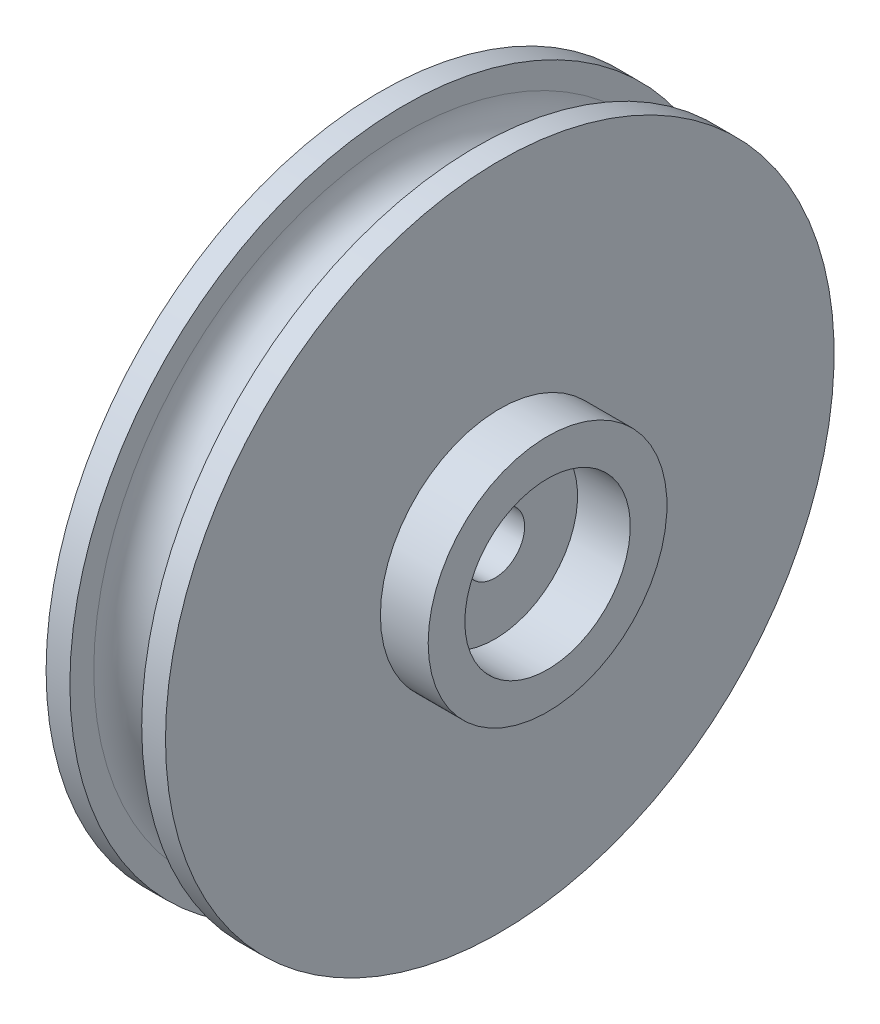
ISO-10303-21;
HEADER;
FILE_DESCRIPTION(('STEP AP214'),'2;1');
FILE_NAME('part.step','',(''),(''),'','','');
FILE_SCHEMA(('AUTOMOTIVE_DESIGN { 1 0 10303 214 1 1 1 1 }'));
ENDSEC;
DATA;
#1=APPLICATION_CONTEXT('core data for automotive mechanical design processes');
#2=APPLICATION_PROTOCOL_DEFINITION('international standard','automotive_design',2000,#1);
#3=PRODUCT_CONTEXT('',#1,'mechanical');
#4=PRODUCT('Part','Part','',(#3));
#5=PRODUCT_RELATED_PRODUCT_CATEGORY('part','',(#4));
#6=PRODUCT_DEFINITION_FORMATION('','',#4);
#7=PRODUCT_DEFINITION_CONTEXT('part definition',#1,'design');
#8=PRODUCT_DEFINITION('design','',#6,#7);
#9=PRODUCT_DEFINITION_SHAPE('','',#8);
#10=(LENGTH_UNIT() NAMED_UNIT(*) SI_UNIT(.MILLI.,.METRE.));
#11=(NAMED_UNIT(*) PLANE_ANGLE_UNIT() SI_UNIT($,.RADIAN.));
#12=(NAMED_UNIT(*) SI_UNIT($,.STERADIAN.) SOLID_ANGLE_UNIT());
#13=UNCERTAINTY_MEASURE_WITH_UNIT(LENGTH_MEASURE(1.E-05),#10,'distance_accuracy_value','');
#14=(GEOMETRIC_REPRESENTATION_CONTEXT(3) GLOBAL_UNCERTAINTY_ASSIGNED_CONTEXT((#13)) GLOBAL_UNIT_ASSIGNED_CONTEXT((#10,
#11,#12)) REPRESENTATION_CONTEXT('',''));
#15=CARTESIAN_POINT('',(0.,0.,0.));
#16=DIRECTION('',(0.,0.,1.));
#17=DIRECTION('',(1.,0.,0.));
#18=AXIS2_PLACEMENT_3D('',#15,#16,#17);
#19=CARTESIAN_POINT('',(0.,0.,0.));
#20=DIRECTION('',(-1.,0.,0.));
#21=DIRECTION('',(0.,0.,1.));
#22=AXIS2_PLACEMENT_3D('',#19,#20,#21);
#23=CYLINDRICAL_SURFACE('',#22,11.);
#24=CARTESIAN_POINT('',(-7.2771,0.,0.));
#25=DIRECTION('',(-1.,0.,0.));
#26=DIRECTION('',(0.,0.,1.));
#27=AXIS2_PLACEMENT_3D('',#24,#25,#26);
#28=CIRCLE('',#27,11.);
#29=CARTESIAN_POINT('',(-7.2771,0.,11.));
#30=VERTEX_POINT('',#29);
#31=EDGE_CURVE('E83',#30,#30,#28,.T.);
#32=ORIENTED_EDGE('',*,*,#31,.F.);
#33=EDGE_LOOP('',(#32));
#34=FACE_BOUND('',#33,.T.);
#35=CARTESIAN_POINT('',(-14.2875,0.,0.));
#36=DIRECTION('',(-1.,0.,0.));
#37=DIRECTION('',(0.,0.,1.));
#38=AXIS2_PLACEMENT_3D('',#35,#36,#37);
#39=CIRCLE('',#38,11.);
#40=CARTESIAN_POINT('',(-14.2875,0.,11.));
#41=VERTEX_POINT('',#40);
#42=EDGE_CURVE('E10',#41,#41,#39,.T.);
#43=ORIENTED_EDGE('',*,*,#42,.T.);
#44=EDGE_LOOP('',(#43));
#45=FACE_BOUND('',#44,.T.);
#46=ADVANCED_FACE('F31',(#34,#45),#23,.F.);
#47=CARTESIAN_POINT('',(-14.2875,15.875,0.));
#48=DIRECTION('',(1.,0.,0.));
#49=DIRECTION('',(0.,0.,-1.));
#50=AXIS2_PLACEMENT_3D('',#47,#48,#49);
#51=PLANE('',#50);
#52=ORIENTED_EDGE('',*,*,#42,.F.);
#53=EDGE_LOOP('',(#52));
#54=FACE_BOUND('',#53,.T.);
#55=CARTESIAN_POINT('',(-14.2875,0.,0.));
#56=DIRECTION('',(-1.,0.,0.));
#57=DIRECTION('',(0.,0.,1.));
#58=AXIS2_PLACEMENT_3D('',#55,#56,#57);
#59=CIRCLE('',#58,15.875);
#60=CARTESIAN_POINT('',(-14.2875,0.,15.875));
#61=VERTEX_POINT('',#60);
#62=EDGE_CURVE('E37',#61,#61,#59,.T.);
#63=ORIENTED_EDGE('',*,*,#62,.T.);
#64=EDGE_LOOP('',(#63));
#65=FACE_BOUND('',#64,.T.);
#66=ADVANCED_FACE('F90',(#54,#65),#51,.F.);
#67=CARTESIAN_POINT('',(0.,0.,0.));
#68=DIRECTION('',(-1.,0.,0.));
#69=DIRECTION('',(0.,0.,1.));
#70=AXIS2_PLACEMENT_3D('',#67,#68,#69);
#71=CYLINDRICAL_SURFACE('',#70,15.875);
#72=ORIENTED_EDGE('',*,*,#62,.F.);
#73=EDGE_LOOP('',(#72));
#74=FACE_BOUND('',#73,.T.);
#75=CARTESIAN_POINT('',(-7.9375,0.,0.));
#76=DIRECTION('',(-1.,0.,0.));
#77=DIRECTION('',(0.,0.,1.));
#78=AXIS2_PLACEMENT_3D('',#75,#76,#77);
#79=CIRCLE('',#78,15.875);
#80=CARTESIAN_POINT('',(-7.9375,0.,15.875));
#81=VERTEX_POINT('',#80);
#82=EDGE_CURVE('E41',#81,#81,#79,.T.);
#83=ORIENTED_EDGE('',*,*,#82,.T.);
#84=EDGE_LOOP('',(#83));
#85=FACE_BOUND('',#84,.T.);
#86=ADVANCED_FACE('F94',(#74,#85),#71,.T.);
#87=CARTESIAN_POINT('',(-7.9375,44.45,0.));
#88=DIRECTION('',(1.,0.,0.));
#89=DIRECTION('',(0.,0.,-1.));
#90=AXIS2_PLACEMENT_3D('',#87,#88,#89);
#91=PLANE('',#90);
#92=ORIENTED_EDGE('',*,*,#82,.F.);
#93=EDGE_LOOP('',(#92));
#94=FACE_BOUND('',#93,.T.);
#95=CARTESIAN_POINT('',(-7.9375,0.,0.));
#96=DIRECTION('',(-1.,0.,0.));
#97=DIRECTION('',(0.,0.,1.));
#98=AXIS2_PLACEMENT_3D('',#95,#96,#97);
#99=CIRCLE('',#98,44.45);
#100=CARTESIAN_POINT('',(-7.9375,0.,44.45));
#101=VERTEX_POINT('',#100);
#102=EDGE_CURVE('E45',#101,#101,#99,.T.);
#103=ORIENTED_EDGE('',*,*,#102,.T.);
#104=EDGE_LOOP('',(#103));
#105=FACE_BOUND('',#104,.T.);
#106=ADVANCED_FACE('F99',(#94,#105),#91,.F.);
#107=CARTESIAN_POINT('',(0.,0.,0.));
#108=DIRECTION('',(-1.,0.,0.));
#109=DIRECTION('',(0.,0.,1.));
#110=AXIS2_PLACEMENT_3D('',#107,#108,#109);
#111=CYLINDRICAL_SURFACE('',#110,44.45);
#112=ORIENTED_EDGE('',*,*,#102,.F.);
#113=EDGE_LOOP('',(#112));
#114=FACE_BOUND('',#113,.T.);
#115=CARTESIAN_POINT('',(-4.7752,0.,0.));
#116=DIRECTION('',(-1.,0.,0.));
#117=DIRECTION('',(0.,0.,1.));
#118=AXIS2_PLACEMENT_3D('',#115,#116,#117);
#119=CIRCLE('',#118,44.45);
#120=CARTESIAN_POINT('',(-4.7752,0.,44.45));
#121=VERTEX_POINT('',#120);
#122=EDGE_CURVE('E50',#121,#121,#119,.T.);
#123=ORIENTED_EDGE('',*,*,#122,.T.);
#124=EDGE_LOOP('',(#123));
#125=FACE_BOUND('',#124,.T.);
#126=ADVANCED_FACE('F105',(#114,#125),#111,.T.);
#127=CARTESIAN_POINT('',(-4.7752,41.275,0.));
#128=DIRECTION('',(-1.,0.,0.));
#129=DIRECTION('',(0.,0.,1.));
#130=AXIS2_PLACEMENT_3D('',#127,#128,#129);
#131=PLANE('',#130);
#132=ORIENTED_EDGE('',*,*,#122,.F.);
#133=EDGE_LOOP('',(#132));
#134=FACE_BOUND('',#133,.T.);
#135=CARTESIAN_POINT('',(-4.7752,0.,0.));
#136=DIRECTION('',(-1.,0.,0.));
#137=DIRECTION('',(0.,0.,1.));
#138=AXIS2_PLACEMENT_3D('',#135,#136,#137);
#139=CIRCLE('',#138,41.275);
#140=CARTESIAN_POINT('',(-4.7752,0.,41.275));
#141=VERTEX_POINT('',#140);
#142=EDGE_CURVE('E53',#141,#141,#139,.T.);
#143=ORIENTED_EDGE('',*,*,#142,.T.);
#144=EDGE_LOOP('',(#143));
#145=FACE_BOUND('',#144,.T.);
#146=ADVANCED_FACE('F109',(#134,#145),#131,.F.);
#147=CARTESIAN_POINT('',(0.,0.,0.));
#148=DIRECTION('',(-1.,0.,0.));
#149=DIRECTION('',(0.,0.,1.));
#150=AXIS2_PLACEMENT_3D('',#147,#148,#149);
#151=TOROIDAL_SURFACE('',#150,41.275,4.7752);
#152=ORIENTED_EDGE('',*,*,#142,.F.);
#153=EDGE_LOOP('',(#152));
#154=FACE_BOUND('',#153,.T.);
#155=CARTESIAN_POINT('',(4.7752,0.,0.));
#156=DIRECTION('',(-1.,0.,0.));
#157=DIRECTION('',(0.,0.,1.));
#158=AXIS2_PLACEMENT_3D('',#155,#156,#157);
#159=CIRCLE('',#158,41.275);
#160=CARTESIAN_POINT('',(4.7752,0.,41.275));
#161=VERTEX_POINT('',#160);
#162=EDGE_CURVE('E56',#161,#161,#159,.T.);
#163=ORIENTED_EDGE('',*,*,#162,.T.);
#164=EDGE_LOOP('',(#163));
#165=FACE_BOUND('',#164,.T.);
#166=ADVANCED_FACE('F113',(#154,#165),#151,.F.);
#167=CARTESIAN_POINT('',(4.7752,44.45,0.));
#168=DIRECTION('',(1.,0.,0.));
#169=DIRECTION('',(0.,0.,-1.));
#170=AXIS2_PLACEMENT_3D('',#167,#168,#169);
#171=PLANE('',#170);
#172=ORIENTED_EDGE('',*,*,#162,.F.);
#173=EDGE_LOOP('',(#172));
#174=FACE_BOUND('',#173,.T.);
#175=CARTESIAN_POINT('',(4.7752,0.,0.));
#176=DIRECTION('',(-1.,0.,0.));
#177=DIRECTION('',(0.,0.,1.));
#178=AXIS2_PLACEMENT_3D('',#175,#176,#177);
#179=CIRCLE('',#178,44.45);
#180=CARTESIAN_POINT('',(4.7752,0.,44.45));
#181=VERTEX_POINT('',#180);
#182=EDGE_CURVE('E59',#181,#181,#179,.T.);
#183=ORIENTED_EDGE('',*,*,#182,.T.);
#184=EDGE_LOOP('',(#183));
#185=FACE_BOUND('',#184,.T.);
#186=ADVANCED_FACE('F117',(#174,#185),#171,.F.);
#187=CARTESIAN_POINT('',(0.,0.,0.));
#188=DIRECTION('',(-1.,0.,0.));
#189=DIRECTION('',(0.,0.,1.));
#190=AXIS2_PLACEMENT_3D('',#187,#188,#189);
#191=CYLINDRICAL_SURFACE('',#190,44.45);
#192=ORIENTED_EDGE('',*,*,#182,.F.);
#193=EDGE_LOOP('',(#192));
#194=FACE_BOUND('',#193,.T.);
#195=CARTESIAN_POINT('',(7.9375,0.,0.));
#196=DIRECTION('',(-1.,0.,0.));
#197=DIRECTION('',(0.,0.,1.));
#198=AXIS2_PLACEMENT_3D('',#195,#196,#197);
#199=CIRCLE('',#198,44.45);
#200=CARTESIAN_POINT('',(7.9375,0.,44.45));
#201=VERTEX_POINT('',#200);
#202=EDGE_CURVE('E62',#201,#201,#199,.T.);
#203=ORIENTED_EDGE('',*,*,#202,.T.);
#204=EDGE_LOOP('',(#203));
#205=FACE_BOUND('',#204,.T.);
#206=ADVANCED_FACE('F121',(#194,#205),#191,.T.);
#207=CARTESIAN_POINT('',(7.9375,15.875,0.));
#208=DIRECTION('',(-1.,0.,0.));
#209=DIRECTION('',(0.,0.,1.));
#210=AXIS2_PLACEMENT_3D('',#207,#208,#209);
#211=PLANE('',#210);
#212=ORIENTED_EDGE('',*,*,#202,.F.);
#213=EDGE_LOOP('',(#212));
#214=FACE_BOUND('',#213,.T.);
#215=CARTESIAN_POINT('',(7.9375,0.,0.));
#216=DIRECTION('',(-1.,0.,0.));
#217=DIRECTION('',(0.,0.,1.));
#218=AXIS2_PLACEMENT_3D('',#215,#216,#217);
#219=CIRCLE('',#218,15.875);
#220=CARTESIAN_POINT('',(7.9375,0.,15.875));
#221=VERTEX_POINT('',#220);
#222=EDGE_CURVE('E65',#221,#221,#219,.T.);
#223=ORIENTED_EDGE('',*,*,#222,.T.);
#224=EDGE_LOOP('',(#223));
#225=FACE_BOUND('',#224,.T.);
#226=ADVANCED_FACE('F125',(#214,#225),#211,.F.);
#227=CARTESIAN_POINT('',(0.,0.,0.));
#228=DIRECTION('',(-1.,0.,0.));
#229=DIRECTION('',(0.,0.,1.));
#230=AXIS2_PLACEMENT_3D('',#227,#228,#229);
#231=CYLINDRICAL_SURFACE('',#230,15.875);
#232=ORIENTED_EDGE('',*,*,#222,.F.);
#233=EDGE_LOOP('',(#232));
#234=FACE_BOUND('',#233,.T.);
#235=CARTESIAN_POINT('',(14.2875,0.,0.));
#236=DIRECTION('',(-1.,0.,0.));
#237=DIRECTION('',(0.,0.,1.));
#238=AXIS2_PLACEMENT_3D('',#235,#236,#237);
#239=CIRCLE('',#238,15.875);
#240=CARTESIAN_POINT('',(14.2875,0.,15.875));
#241=VERTEX_POINT('',#240);
#242=EDGE_CURVE('E68',#241,#241,#239,.T.);
#243=ORIENTED_EDGE('',*,*,#242,.T.);
#244=EDGE_LOOP('',(#243));
#245=FACE_BOUND('',#244,.T.);
#246=ADVANCED_FACE('F129',(#234,#245),#231,.T.);
#247=CARTESIAN_POINT('',(14.2875,15.875,0.));
#248=DIRECTION('',(-1.,0.,0.));
#249=DIRECTION('',(0.,0.,1.));
#250=AXIS2_PLACEMENT_3D('',#247,#248,#249);
#251=PLANE('',#250);
#252=ORIENTED_EDGE('',*,*,#242,.F.);
#253=EDGE_LOOP('',(#252));
#254=FACE_BOUND('',#253,.T.);
#255=CARTESIAN_POINT('',(14.2875,0.,0.));
#256=DIRECTION('',(-1.,0.,0.));
#257=DIRECTION('',(0.,0.,1.));
#258=AXIS2_PLACEMENT_3D('',#255,#256,#257);
#259=CIRCLE('',#258,11.);
#260=CARTESIAN_POINT('',(14.2875,0.,11.));
#261=VERTEX_POINT('',#260);
#262=EDGE_CURVE('E71',#261,#261,#259,.T.);
#263=ORIENTED_EDGE('',*,*,#262,.T.);
#264=EDGE_LOOP('',(#263));
#265=FACE_BOUND('',#264,.T.);
#266=ADVANCED_FACE('F133',(#254,#265),#251,.F.);
#267=CARTESIAN_POINT('',(0.,0.,0.));
#268=DIRECTION('',(-1.,0.,0.));
#269=DIRECTION('',(0.,0.,1.));
#270=AXIS2_PLACEMENT_3D('',#267,#268,#269);
#271=CYLINDRICAL_SURFACE('',#270,11.);
#272=ORIENTED_EDGE('',*,*,#262,.F.);
#273=EDGE_LOOP('',(#272));
#274=FACE_BOUND('',#273,.T.);
#275=CARTESIAN_POINT('',(7.2771,0.,0.));
#276=DIRECTION('',(-1.,0.,0.));
#277=DIRECTION('',(0.,0.,1.));
#278=AXIS2_PLACEMENT_3D('',#275,#276,#277);
#279=CIRCLE('',#278,11.);
#280=CARTESIAN_POINT('',(7.2771,0.,11.));
#281=VERTEX_POINT('',#280);
#282=EDGE_CURVE('E74',#281,#281,#279,.T.);
#283=ORIENTED_EDGE('',*,*,#282,.T.);
#284=EDGE_LOOP('',(#283));
#285=FACE_BOUND('',#284,.T.);
#286=ADVANCED_FACE('F137',(#274,#285),#271,.F.);
#287=CARTESIAN_POINT('',(7.2771,3.9624,0.));
#288=DIRECTION('',(-1.,0.,0.));
#289=DIRECTION('',(0.,0.,1.));
#290=AXIS2_PLACEMENT_3D('',#287,#288,#289);
#291=PLANE('',#290);
#292=ORIENTED_EDGE('',*,*,#282,.F.);
#293=EDGE_LOOP('',(#292));
#294=FACE_BOUND('',#293,.T.);
#295=CARTESIAN_POINT('',(7.2771,0.,0.));
#296=DIRECTION('',(-1.,0.,0.));
#297=DIRECTION('',(0.,0.,1.));
#298=AXIS2_PLACEMENT_3D('',#295,#296,#297);
#299=CIRCLE('',#298,3.9624);
#300=CARTESIAN_POINT('',(7.2771,0.,3.9624));
#301=VERTEX_POINT('',#300);
#302=EDGE_CURVE('E77',#301,#301,#299,.T.);
#303=ORIENTED_EDGE('',*,*,#302,.T.);
#304=EDGE_LOOP('',(#303));
#305=FACE_BOUND('',#304,.T.);
#306=ADVANCED_FACE('F141',(#294,#305),#291,.F.);
#307=CARTESIAN_POINT('',(0.,0.,0.));
#308=DIRECTION('',(-1.,0.,0.));
#309=DIRECTION('',(0.,0.,1.));
#310=AXIS2_PLACEMENT_3D('',#307,#308,#309);
#311=CYLINDRICAL_SURFACE('',#310,3.9624);
#312=ORIENTED_EDGE('',*,*,#302,.F.);
#313=EDGE_LOOP('',(#312));
#314=FACE_BOUND('',#313,.T.);
#315=CARTESIAN_POINT('',(-7.2771,0.,0.));
#316=DIRECTION('',(-1.,0.,0.));
#317=DIRECTION('',(0.,0.,1.));
#318=AXIS2_PLACEMENT_3D('',#315,#316,#317);
#319=CIRCLE('',#318,3.9624);
#320=CARTESIAN_POINT('',(-7.2771,0.,3.9624));
#321=VERTEX_POINT('',#320);
#322=EDGE_CURVE('E80',#321,#321,#319,.T.);
#323=ORIENTED_EDGE('',*,*,#322,.T.);
#324=EDGE_LOOP('',(#323));
#325=FACE_BOUND('',#324,.T.);
#326=ADVANCED_FACE('F145',(#314,#325),#311,.F.);
#327=CARTESIAN_POINT('',(-7.2771,11.,0.));
#328=DIRECTION('',(1.,0.,0.));
#329=DIRECTION('',(0.,0.,-1.));
#330=AXIS2_PLACEMENT_3D('',#327,#328,#329);
#331=PLANE('',#330);
#332=ORIENTED_EDGE('',*,*,#322,.F.);
#333=EDGE_LOOP('',(#332));
#334=FACE_BOUND('',#333,.T.);
#335=ORIENTED_EDGE('',*,*,#31,.T.);
#336=EDGE_LOOP('',(#335));
#337=FACE_BOUND('',#336,.T.);
#338=ADVANCED_FACE('F87',(#334,#337),#331,.F.);
#339=CLOSED_SHELL('',(#46,#66,#86,#106,#126,#146,#166,#186,#206,#226,#246,#266,#286,#306,#326,#338));
#340=MANIFOLD_SOLID_BREP('B2',#339);
#341=ADVANCED_BREP_SHAPE_REPRESENTATION('',(#18,#340),#14);
#342=SHAPE_DEFINITION_REPRESENTATION(#9,#341);
ENDSEC;
END-ISO-10303-21;
